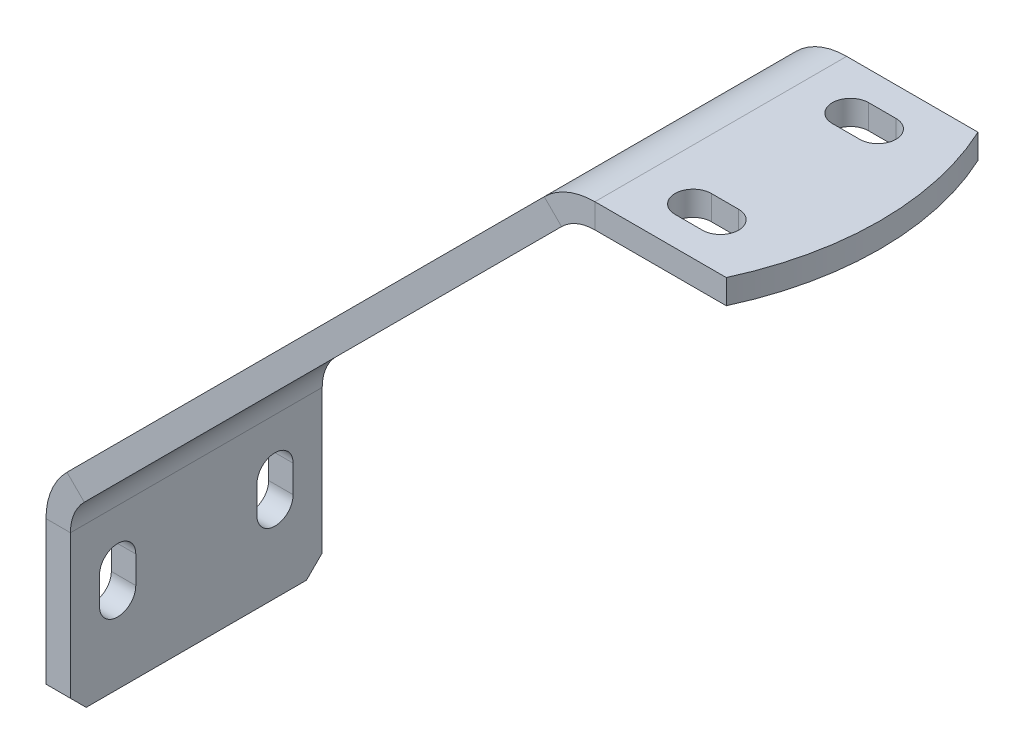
ISO-10303-21;
HEADER;
FILE_DESCRIPTION(('STEP AP214'),'2;1');
FILE_NAME('part.step','',(''),(''),'','','');
FILE_SCHEMA(('AUTOMOTIVE_DESIGN { 1 0 10303 214 1 1 1 1 }'));
ENDSEC;
DATA;
#1=APPLICATION_CONTEXT('core data for automotive mechanical design processes');
#2=APPLICATION_PROTOCOL_DEFINITION('international standard','automotive_design',2000,#1);
#3=PRODUCT_CONTEXT('',#1,'mechanical');
#4=PRODUCT('Part','Part','',(#3));
#5=PRODUCT_RELATED_PRODUCT_CATEGORY('part','',(#4));
#6=PRODUCT_DEFINITION_FORMATION('','',#4);
#7=PRODUCT_DEFINITION_CONTEXT('part definition',#1,'design');
#8=PRODUCT_DEFINITION('design','',#6,#7);
#9=PRODUCT_DEFINITION_SHAPE('','',#8);
#10=(LENGTH_UNIT() NAMED_UNIT(*) SI_UNIT(.MILLI.,.METRE.));
#11=(NAMED_UNIT(*) PLANE_ANGLE_UNIT() SI_UNIT($,.RADIAN.));
#12=(NAMED_UNIT(*) SI_UNIT($,.STERADIAN.) SOLID_ANGLE_UNIT());
#13=UNCERTAINTY_MEASURE_WITH_UNIT(LENGTH_MEASURE(1.E-05),#10,'distance_accuracy_value','');
#14=(GEOMETRIC_REPRESENTATION_CONTEXT(3) GLOBAL_UNCERTAINTY_ASSIGNED_CONTEXT((#13)) GLOBAL_UNIT_ASSIGNED_CONTEXT((#10,
#11,#12)) REPRESENTATION_CONTEXT('',''));
#15=CARTESIAN_POINT('',(0.,0.,0.));
#16=DIRECTION('',(0.,0.,1.));
#17=DIRECTION('',(1.,0.,0.));
#18=AXIS2_PLACEMENT_3D('',#15,#16,#17);
#19=CARTESIAN_POINT('',(104.775,142.875,25.4));
#20=DIRECTION('',(0.,1.,0.));
#21=DIRECTION('',(0.,0.,1.));
#22=AXIS2_PLACEMENT_3D('',#19,#20,#21);
#23=PLANE('',#22);
#24=DIRECTION('',(1.,0.,0.));
#25=VECTOR('',#24,1.);
#26=CARTESIAN_POINT('',(121.0691,142.875,-19.5326));
#27=LINE('',#26,#25);
#28=CARTESIAN_POINT('',(121.0691,142.875,-19.5326));
#29=VERTEX_POINT('',#28);
#30=CARTESIAN_POINT('',(126.5809,142.875,-19.5326));
#31=VERTEX_POINT('',#30);
#32=EDGE_CURVE('E1196',#29,#31,#27,.T.);
#33=ORIENTED_EDGE('',*,*,#32,.T.);
#34=CARTESIAN_POINT('',(126.5809,142.875,-15.875));
#35=DIRECTION('',(0.,-1.,0.));
#36=DIRECTION('',(0.,0.,-1.));
#37=AXIS2_PLACEMENT_3D('',#34,#35,#36);
#38=CIRCLE('',#37,3.6576);
#39=CARTESIAN_POINT('',(126.5809,142.875,-12.2174));
#40=VERTEX_POINT('',#39);
#41=EDGE_CURVE('E1217',#31,#40,#38,.T.);
#42=ORIENTED_EDGE('',*,*,#41,.T.);
#43=DIRECTION('',(1.,0.,0.));
#44=VECTOR('',#43,1.);
#45=CARTESIAN_POINT('',(121.0691,142.875,-12.2174));
#46=LINE('',#45,#44);
#47=CARTESIAN_POINT('',(121.0691,142.875,-12.2174));
#48=VERTEX_POINT('',#47);
#49=EDGE_CURVE('E1198',#48,#40,#46,.T.);
#50=ORIENTED_EDGE('',*,*,#49,.F.);
#51=CARTESIAN_POINT('',(121.0691,142.875,-15.875));
#52=DIRECTION('',(0.,-1.,0.));
#53=DIRECTION('',(0.,0.,-1.));
#54=AXIS2_PLACEMENT_3D('',#51,#52,#53);
#55=CIRCLE('',#54,3.6576);
#56=EDGE_CURVE('E1206',#48,#29,#55,.T.);
#57=ORIENTED_EDGE('',*,*,#56,.T.);
#58=EDGE_LOOP('',(#33,#42,#50,#57));
#59=FACE_BOUND('',#58,.T.);
#60=CARTESIAN_POINT('',(121.0691,142.875,15.875));
#61=DIRECTION('',(0.,-1.,0.));
#62=DIRECTION('',(0.,0.,-1.));
#63=AXIS2_PLACEMENT_3D('',#60,#61,#62);
#64=CIRCLE('',#63,3.6576);
#65=CARTESIAN_POINT('',(121.0691,142.875,19.5326));
#66=VERTEX_POINT('',#65);
#67=CARTESIAN_POINT('',(121.0691,142.875,12.2174));
#68=VERTEX_POINT('',#67);
#69=EDGE_CURVE('E371',#66,#68,#64,.T.);
#70=ORIENTED_EDGE('',*,*,#69,.T.);
#71=DIRECTION('',(1.,0.,0.));
#72=VECTOR('',#71,1.);
#73=CARTESIAN_POINT('',(121.0691,142.875,12.2174));
#74=LINE('',#73,#72);
#75=CARTESIAN_POINT('',(126.5809,142.875,12.2174));
#76=VERTEX_POINT('',#75);
#77=EDGE_CURVE('E1166',#68,#76,#74,.T.);
#78=ORIENTED_EDGE('',*,*,#77,.T.);
#79=CARTESIAN_POINT('',(126.5809,142.875,15.875));
#80=DIRECTION('',(0.,-1.,0.));
#81=DIRECTION('',(0.,0.,-1.));
#82=AXIS2_PLACEMENT_3D('',#79,#80,#81);
#83=CIRCLE('',#82,3.6576);
#84=CARTESIAN_POINT('',(126.5809,142.875,19.5326));
#85=VERTEX_POINT('',#84);
#86=EDGE_CURVE('E1174',#76,#85,#83,.T.);
#87=ORIENTED_EDGE('',*,*,#86,.T.);
#88=DIRECTION('',(1.,0.,0.));
#89=VECTOR('',#88,1.);
#90=CARTESIAN_POINT('',(121.0691,142.875,19.5326));
#91=LINE('',#90,#89);
#92=EDGE_CURVE('E1175',#66,#85,#91,.T.);
#93=ORIENTED_EDGE('',*,*,#92,.F.);
#94=EDGE_LOOP('',(#70,#78,#87,#93));
#95=FACE_BOUND('',#94,.T.);
#96=CARTESIAN_POINT('',(82.5500000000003,142.875,0.));
#97=DIRECTION('',(0.,-1.,0.));
#98=DIRECTION('',(0.,0.,-1.));
#99=AXIS2_PLACEMENT_3D('',#96,#97,#98);
#100=CIRCLE('',#99,60.325);
#101=CARTESIAN_POINT('',(137.266959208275,142.875,-25.4));
#102=VERTEX_POINT('',#101);
#103=CARTESIAN_POINT('',(137.266959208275,142.875,25.4));
#104=VERTEX_POINT('',#103);
#105=EDGE_CURVE('E548',#102,#104,#100,.T.);
#106=ORIENTED_EDGE('',*,*,#105,.F.);
#107=DIRECTION('',(1.,0.,0.));
#108=VECTOR('',#107,1.);
#109=CARTESIAN_POINT('',(104.775,142.875,-25.4));
#110=LINE('',#109,#108);
#111=CARTESIAN_POINT('',(110.764619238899,142.875,-25.4));
#112=VERTEX_POINT('',#111);
#113=EDGE_CURVE('E552',#112,#102,#110,.T.);
#114=ORIENTED_EDGE('',*,*,#113,.F.);
#115=DIRECTION('',(0.,0.,-1.));
#116=VECTOR('',#115,1.);
#117=CARTESIAN_POINT('',(110.764619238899,142.875,25.4));
#118=LINE('',#117,#116);
#119=CARTESIAN_POINT('',(110.764619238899,142.875,25.4));
#120=VERTEX_POINT('',#119);
#121=EDGE_CURVE('E628',#120,#112,#118,.T.);
#122=ORIENTED_EDGE('',*,*,#121,.F.);
#123=DIRECTION('',(1.,0.,0.));
#124=VECTOR('',#123,1.);
#125=CARTESIAN_POINT('',(104.775,142.875,25.4));
#126=LINE('',#125,#124);
#127=EDGE_CURVE('E555',#120,#104,#126,.T.);
#128=ORIENTED_EDGE('',*,*,#127,.T.);
#129=EDGE_LOOP('',(#106,#114,#122,#128));
#130=FACE_BOUND('',#129,.T.);
#131=ADVANCED_FACE('F348',(#59,#95,#130),#23,.T.);
#132=CARTESIAN_POINT('',(104.775,137.93978,25.4));
#133=DIRECTION('',(0.,1.,0.));
#134=DIRECTION('',(0.,0.,1.));
#135=AXIS2_PLACEMENT_3D('',#132,#133,#134);
#136=PLANE('',#135);
#137=DIRECTION('',(1.,0.,0.));
#138=VECTOR('',#137,1.);
#139=CARTESIAN_POINT('',(121.0691,137.93978,19.5326));
#140=LINE('',#139,#138);
#141=CARTESIAN_POINT('',(121.0691,137.93978,19.5326));
#142=VERTEX_POINT('',#141);
#143=CARTESIAN_POINT('',(126.5809,137.93978,19.5326));
#144=VERTEX_POINT('',#143);
#145=EDGE_CURVE('E1177',#142,#144,#140,.T.);
#146=ORIENTED_EDGE('',*,*,#145,.T.);
#147=CARTESIAN_POINT('',(126.5809,137.93978,15.875));
#148=DIRECTION('',(0.,-1.,0.));
#149=DIRECTION('',(0.,0.,-1.));
#150=AXIS2_PLACEMENT_3D('',#147,#148,#149);
#151=CIRCLE('',#150,3.6576);
#152=CARTESIAN_POINT('',(126.5809,137.93978,12.2174));
#153=VERTEX_POINT('',#152);
#154=EDGE_CURVE('E363',#153,#144,#151,.T.);
#155=ORIENTED_EDGE('',*,*,#154,.F.);
#156=DIRECTION('',(1.,0.,0.));
#157=VECTOR('',#156,1.);
#158=CARTESIAN_POINT('',(121.0691,137.93978,12.2174));
#159=LINE('',#158,#157);
#160=CARTESIAN_POINT('',(121.0691,137.93978,12.2174));
#161=VERTEX_POINT('',#160);
#162=EDGE_CURVE('E1168',#161,#153,#159,.T.);
#163=ORIENTED_EDGE('',*,*,#162,.F.);
#164=CARTESIAN_POINT('',(121.0691,137.93978,15.875));
#165=DIRECTION('',(0.,-1.,0.));
#166=DIRECTION('',(0.,0.,-1.));
#167=AXIS2_PLACEMENT_3D('',#164,#165,#166);
#168=CIRCLE('',#167,3.6576);
#169=EDGE_CURVE('E1184',#142,#161,#168,.T.);
#170=ORIENTED_EDGE('',*,*,#169,.F.);
#171=EDGE_LOOP('',(#146,#155,#163,#170));
#172=FACE_BOUND('',#171,.T.);
#173=CARTESIAN_POINT('',(121.0691,137.93978,-15.875));
#174=DIRECTION('',(0.,-1.,0.));
#175=DIRECTION('',(0.,0.,-1.));
#176=AXIS2_PLACEMENT_3D('',#173,#174,#175);
#177=CIRCLE('',#176,3.6576);
#178=CARTESIAN_POINT('',(121.0691,137.93978,-12.2174));
#179=VERTEX_POINT('',#178);
#180=CARTESIAN_POINT('',(121.0691,137.93978,-19.5326));
#181=VERTEX_POINT('',#180);
#182=EDGE_CURVE('E1203',#179,#181,#177,.T.);
#183=ORIENTED_EDGE('',*,*,#182,.F.);
#184=DIRECTION('',(1.,0.,0.));
#185=VECTOR('',#184,1.);
#186=CARTESIAN_POINT('',(121.0691,137.93978,-12.2174));
#187=LINE('',#186,#185);
#188=CARTESIAN_POINT('',(126.5809,137.93978,-12.2174));
#189=VERTEX_POINT('',#188);
#190=EDGE_CURVE('E1200',#179,#189,#187,.T.);
#191=ORIENTED_EDGE('',*,*,#190,.T.);
#192=CARTESIAN_POINT('',(126.5809,137.93978,-15.875));
#193=DIRECTION('',(0.,-1.,0.));
#194=DIRECTION('',(0.,0.,-1.));
#195=AXIS2_PLACEMENT_3D('',#192,#193,#194);
#196=CIRCLE('',#195,3.6576);
#197=CARTESIAN_POINT('',(126.5809,137.93978,-19.5326));
#198=VERTEX_POINT('',#197);
#199=EDGE_CURVE('E1214',#198,#189,#196,.T.);
#200=ORIENTED_EDGE('',*,*,#199,.F.);
#201=DIRECTION('',(1.,0.,0.));
#202=VECTOR('',#201,1.);
#203=CARTESIAN_POINT('',(121.0691,137.93978,-19.5326));
#204=LINE('',#203,#202);
#205=EDGE_CURVE('E1169',#181,#198,#204,.T.);
#206=ORIENTED_EDGE('',*,*,#205,.F.);
#207=EDGE_LOOP('',(#183,#191,#200,#206));
#208=FACE_BOUND('',#207,.T.);
#209=DIRECTION('',(1.,0.,0.));
#210=VECTOR('',#209,1.);
#211=CARTESIAN_POINT('',(104.775,137.93978,-25.4));
#212=LINE('',#211,#210);
#213=CARTESIAN_POINT('',(110.764619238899,137.93978,-25.4));
#214=VERTEX_POINT('',#213);
#215=CARTESIAN_POINT('',(137.266959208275,137.93978,-25.4));
#216=VERTEX_POINT('',#215);
#217=EDGE_CURVE('E573',#214,#216,#212,.T.);
#218=ORIENTED_EDGE('',*,*,#217,.T.);
#219=CARTESIAN_POINT('',(82.5500000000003,137.93978,0.));
#220=DIRECTION('',(0.,-1.,0.));
#221=DIRECTION('',(0.,0.,-1.));
#222=AXIS2_PLACEMENT_3D('',#219,#220,#221);
#223=CIRCLE('',#222,60.325);
#224=CARTESIAN_POINT('',(137.266959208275,137.93978,25.4));
#225=VERTEX_POINT('',#224);
#226=EDGE_CURVE('E559',#216,#225,#223,.T.);
#227=ORIENTED_EDGE('',*,*,#226,.T.);
#228=DIRECTION('',(1.,0.,0.));
#229=VECTOR('',#228,1.);
#230=CARTESIAN_POINT('',(104.775,137.93978,25.4));
#231=LINE('',#230,#229);
#232=CARTESIAN_POINT('',(110.764619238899,137.93978,25.4));
#233=VERTEX_POINT('',#232);
#234=EDGE_CURVE('E599',#233,#225,#231,.T.);
#235=ORIENTED_EDGE('',*,*,#234,.F.);
#236=DIRECTION('',(0.,0.,-1.));
#237=VECTOR('',#236,1.);
#238=CARTESIAN_POINT('',(110.764619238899,137.93978,25.4));
#239=LINE('',#238,#237);
#240=EDGE_CURVE('E600',#233,#214,#239,.T.);
#241=ORIENTED_EDGE('',*,*,#240,.T.);
#242=EDGE_LOOP('',(#218,#227,#235,#241));
#243=FACE_BOUND('',#242,.T.);
#244=ADVANCED_FACE('F730',(#172,#208,#243),#136,.F.);
#245=CARTESIAN_POINT('',(110.764619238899,128.41478,-25.4));
#246=DIRECTION('',(0.,0.,1.));
#247=DIRECTION('',(1.,0.,0.));
#248=AXIS2_PLACEMENT_3D('',#245,#246,#247);
#249=PLANE('',#248);
#250=DIRECTION('',(0.,-1.,0.));
#251=VECTOR('',#250,1.);
#252=CARTESIAN_POINT('',(137.266959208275,142.875,-25.4));
#253=LINE('',#252,#251);
#254=EDGE_CURVE('E562',#102,#216,#253,.T.);
#255=ORIENTED_EDGE('',*,*,#254,.T.);
#256=ORIENTED_EDGE('',*,*,#217,.F.);
#257=DIRECTION('',(0.,1.,0.));
#258=VECTOR('',#257,1.);
#259=CARTESIAN_POINT('',(110.764619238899,137.93978,-25.4));
#260=LINE('',#259,#258);
#261=EDGE_CURVE('E570',#214,#112,#260,.T.);
#262=ORIENTED_EDGE('',*,*,#261,.T.);
#263=ORIENTED_EDGE('',*,*,#113,.T.);
#264=EDGE_LOOP('',(#255,#256,#262,#263));
#265=FACE_BOUND('',#264,.T.);
#266=ADVANCED_FACE('F569',(#265),#249,.F.);
#267=CARTESIAN_POINT('',(104.029427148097,135.149972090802,25.4));
#268=DIRECTION('',(0.,0.,1.));
#269=DIRECTION('',(1.,0.,0.));
#270=AXIS2_PLACEMENT_3D('',#267,#268,#269);
#271=PLANE('',#270);
#272=ORIENTED_EDGE('',*,*,#234,.T.);
#273=DIRECTION('',(0.,-1.,0.));
#274=VECTOR('',#273,1.);
#275=CARTESIAN_POINT('',(137.266959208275,142.875,25.4));
#276=LINE('',#275,#274);
#277=EDGE_CURVE('E558',#104,#225,#276,.T.);
#278=ORIENTED_EDGE('',*,*,#277,.F.);
#279=ORIENTED_EDGE('',*,*,#127,.F.);
#280=DIRECTION('',(0.,-1.,0.));
#281=VECTOR('',#280,1.);
#282=CARTESIAN_POINT('',(110.764619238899,142.875,25.4));
#283=LINE('',#282,#281);
#284=EDGE_CURVE('E635',#120,#233,#283,.T.);
#285=ORIENTED_EDGE('',*,*,#284,.T.);
#286=EDGE_LOOP('',(#272,#278,#279,#285));
#287=FACE_BOUND('',#286,.T.);
#288=ADVANCED_FACE('F785',(#287),#271,.T.);
#289=CARTESIAN_POINT('',(0.,0.,25.4));
#290=DIRECTION('',(-1.,0.,0.));
#291=DIRECTION('',(0.,0.,1.));
#292=AXIS2_PLACEMENT_3D('',#289,#290,#291);
#293=PLANE('',#292);
#294=DIRECTION('',(0.,1.,0.));
#295=VECTOR('',#294,1.);
#296=CARTESIAN_POINT('',(0.,0.,-25.4));
#297=LINE('',#296,#295);
#298=CARTESIAN_POINT('',(0.,3.175,-25.4));
#299=VERTEX_POINT('',#298);
#300=CARTESIAN_POINT('',(0.,32.1103807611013,-25.4));
#301=VERTEX_POINT('',#300);
#302=EDGE_CURVE('E586',#299,#301,#297,.T.);
#303=ORIENTED_EDGE('',*,*,#302,.F.);
#304=DIRECTION('',(0.,0.707106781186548,-0.707106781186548));
#305=VECTOR('',#304,1.);
#306=CARTESIAN_POINT('',(0.,-23.8125,1.5875));
#307=LINE('',#306,#305);
#308=CARTESIAN_POINT('',(0.,0.,-22.225));
#309=VERTEX_POINT('',#308);
#310=EDGE_CURVE('E659',#299,#309,#307,.F.);
#311=ORIENTED_EDGE('',*,*,#310,.T.);
#312=DIRECTION('',(0.,0.,-1.));
#313=VECTOR('',#312,1.);
#314=CARTESIAN_POINT('',(0.,0.,25.4));
#315=LINE('',#314,#313);
#316=CARTESIAN_POINT('',(0.,0.,22.225));
#317=VERTEX_POINT('',#316);
#318=EDGE_CURVE('E616',#317,#309,#315,.T.);
#319=ORIENTED_EDGE('',*,*,#318,.F.);
#320=DIRECTION('',(0.,-0.707106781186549,-0.707106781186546));
#321=VECTOR('',#320,1.);
#322=CARTESIAN_POINT('',(0.,1.5875,23.8125));
#323=LINE('',#322,#321);
#324=CARTESIAN_POINT('',(0.,3.17500000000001,25.4));
#325=VERTEX_POINT('',#324);
#326=EDGE_CURVE('E650',#317,#325,#323,.F.);
#327=ORIENTED_EDGE('',*,*,#326,.T.);
#328=DIRECTION('',(0.,1.,0.));
#329=VECTOR('',#328,1.);
#330=CARTESIAN_POINT('',(0.,0.,25.4));
#331=LINE('',#330,#329);
#332=CARTESIAN_POINT('',(0.,32.1103807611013,25.4));
#333=VERTEX_POINT('',#332);
#334=EDGE_CURVE('E684',#325,#333,#331,.T.);
#335=ORIENTED_EDGE('',*,*,#334,.T.);
#336=DIRECTION('',(0.,0.,-1.));
#337=VECTOR('',#336,1.);
#338=CARTESIAN_POINT('',(0.,32.1103807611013,25.4));
#339=LINE('',#338,#337);
#340=EDGE_CURVE('E619',#333,#301,#339,.T.);
#341=ORIENTED_EDGE('',*,*,#340,.T.);
#342=EDGE_LOOP('',(#303,#311,#319,#327,#335,#341));
#343=FACE_BOUND('',#342,.T.);
#344=DIRECTION('',(0.,1.,0.));
#345=VECTOR('',#344,1.);
#346=CARTESIAN_POINT('',(0.,16.2941,-19.5326));
#347=LINE('',#346,#345);
#348=CARTESIAN_POINT('',(0.,16.2941,-19.5326));
#349=VERTEX_POINT('',#348);
#350=CARTESIAN_POINT('',(0.,21.8059,-19.5326));
#351=VERTEX_POINT('',#350);
#352=EDGE_CURVE('E1259',#349,#351,#347,.T.);
#353=ORIENTED_EDGE('',*,*,#352,.T.);
#354=CARTESIAN_POINT('',(0.,21.8059,-15.875));
#355=DIRECTION('',(1.,0.,0.));
#356=DIRECTION('',(0.,0.,-1.));
#357=AXIS2_PLACEMENT_3D('',#354,#355,#356);
#358=CIRCLE('',#357,3.6576);
#359=CARTESIAN_POINT('',(0.,21.8059,-12.2174));
#360=VERTEX_POINT('',#359);
#361=EDGE_CURVE('E1280',#351,#360,#358,.T.);
#362=ORIENTED_EDGE('',*,*,#361,.T.);
#363=DIRECTION('',(0.,1.,0.));
#364=VECTOR('',#363,1.);
#365=CARTESIAN_POINT('',(0.,16.2941,-12.2174));
#366=LINE('',#365,#364);
#367=CARTESIAN_POINT('',(0.,16.2941,-12.2174));
#368=VERTEX_POINT('',#367);
#369=EDGE_CURVE('E1262',#368,#360,#366,.T.);
#370=ORIENTED_EDGE('',*,*,#369,.F.);
#371=CARTESIAN_POINT('',(0.,16.2941,-15.875));
#372=DIRECTION('',(1.,0.,0.));
#373=DIRECTION('',(0.,0.,-1.));
#374=AXIS2_PLACEMENT_3D('',#371,#372,#373);
#375=CIRCLE('',#374,3.6576);
#376=EDGE_CURVE('E1270',#368,#349,#375,.T.);
#377=ORIENTED_EDGE('',*,*,#376,.T.);
#378=EDGE_LOOP('',(#353,#362,#370,#377));
#379=FACE_BOUND('',#378,.T.);
#380=DIRECTION('',(0.,1.,0.));
#381=VECTOR('',#380,1.);
#382=CARTESIAN_POINT('',(0.,16.2941,12.2174));
#383=LINE('',#382,#381);
#384=CARTESIAN_POINT('',(0.,16.2941,12.2174));
#385=VERTEX_POINT('',#384);
#386=CARTESIAN_POINT('',(0.,21.8059,12.2174));
#387=VERTEX_POINT('',#386);
#388=EDGE_CURVE('E1227',#385,#387,#383,.T.);
#389=ORIENTED_EDGE('',*,*,#388,.T.);
#390=CARTESIAN_POINT('',(0.,21.8059,15.875));
#391=DIRECTION('',(1.,0.,0.));
#392=DIRECTION('',(0.,0.,-1.));
#393=AXIS2_PLACEMENT_3D('',#390,#391,#392);
#394=CIRCLE('',#393,3.6576);
#395=CARTESIAN_POINT('',(0.,21.8059,19.5326));
#396=VERTEX_POINT('',#395);
#397=EDGE_CURVE('E1249',#387,#396,#394,.T.);
#398=ORIENTED_EDGE('',*,*,#397,.T.);
#399=DIRECTION('',(0.,1.,0.));
#400=VECTOR('',#399,1.);
#401=CARTESIAN_POINT('',(0.,16.2941,19.5326));
#402=LINE('',#401,#400);
#403=CARTESIAN_POINT('',(0.,16.2941,19.5326));
#404=VERTEX_POINT('',#403);
#405=EDGE_CURVE('E1230',#404,#396,#402,.T.);
#406=ORIENTED_EDGE('',*,*,#405,.F.);
#407=CARTESIAN_POINT('',(0.,16.2941,15.875));
#408=DIRECTION('',(1.,0.,0.));
#409=DIRECTION('',(0.,0.,-1.));
#410=AXIS2_PLACEMENT_3D('',#407,#408,#409);
#411=CIRCLE('',#410,3.6576);
#412=EDGE_CURVE('E1238',#404,#385,#411,.T.);
#413=ORIENTED_EDGE('',*,*,#412,.T.);
#414=EDGE_LOOP('',(#389,#398,#406,#413));
#415=FACE_BOUND('',#414,.T.);
#416=ADVANCED_FACE('F679',(#343,#379,#415),#293,.T.);
#417=CARTESIAN_POINT('',(4.23530038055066,42.3353003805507,25.4));
#418=DIRECTION('',(0.,0.,1.));
#419=DIRECTION('',(1.,0.,0.));
#420=AXIS2_PLACEMENT_3D('',#417,#418,#419);
#421=PLANE('',#420);
#422=DIRECTION('',(0.707106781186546,-0.707106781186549,0.));
#423=VECTOR('',#422,1.);
#424=CARTESIAN_POINT('',(4.23530038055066,42.3353003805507,25.4));
#425=LINE('',#424,#423);
#426=CARTESIAN_POINT('',(4.23530038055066,42.3353003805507,25.4));
#427=VERTEX_POINT('',#426);
#428=CARTESIAN_POINT('',(7.72502790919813,38.8455728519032,25.4));
#429=VERTEX_POINT('',#428);
#430=EDGE_CURVE('E645',#427,#429,#425,.T.);
#431=ORIENTED_EDGE('',*,*,#430,.F.);
#432=CARTESIAN_POINT('',(14.46022,32.1103807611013,25.4));
#433=DIRECTION('',(0.,0.,1.));
#434=DIRECTION('',(1.,0.,0.));
#435=AXIS2_PLACEMENT_3D('',#432,#433,#434);
#436=CIRCLE('',#435,14.46022);
#437=EDGE_CURVE('E709',#333,#427,#436,.F.);
#438=ORIENTED_EDGE('',*,*,#437,.F.);
#439=DIRECTION('',(-1.,0.,0.));
#440=VECTOR('',#439,1.);
#441=CARTESIAN_POINT('',(4.93522,32.1103807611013,25.4));
#442=LINE('',#441,#440);
#443=CARTESIAN_POINT('',(4.93522,32.1103807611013,25.4));
#444=VERTEX_POINT('',#443);
#445=EDGE_CURVE('E642',#444,#333,#442,.T.);
#446=ORIENTED_EDGE('',*,*,#445,.F.);
#447=CARTESIAN_POINT('',(14.46022,32.1103807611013,25.4));
#448=DIRECTION('',(0.,0.,1.));
#449=DIRECTION('',(1.,0.,0.));
#450=AXIS2_PLACEMENT_3D('',#447,#448,#449);
#451=CIRCLE('',#450,9.525);
#452=EDGE_CURVE('E700',#444,#429,#451,.F.);
#453=ORIENTED_EDGE('',*,*,#452,.T.);
#454=EDGE_LOOP('',(#431,#438,#446,#453));
#455=FACE_BOUND('',#454,.T.);
#456=ADVANCED_FACE('F748',(#455),#421,.T.);
#457=CARTESIAN_POINT('',(4.93522,32.1103807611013,25.4));
#458=DIRECTION('',(0.,0.,1.));
#459=DIRECTION('',(1.,0.,0.));
#460=AXIS2_PLACEMENT_3D('',#457,#458,#459);
#461=PLANE('',#460);
#462=DIRECTION('',(0.707106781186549,0.707106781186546,0.));
#463=VECTOR('',#462,1.);
#464=CARTESIAN_POINT('',(0.,38.1,25.4));
#465=LINE('',#464,#463);
#466=CARTESIAN_POINT('',(100.53969961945,138.639699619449,25.4));
#467=VERTEX_POINT('',#466);
#468=EDGE_CURVE('E711',#427,#467,#465,.T.);
#469=ORIENTED_EDGE('',*,*,#468,.F.);
#470=ORIENTED_EDGE('',*,*,#430,.T.);
#471=DIRECTION('',(0.707106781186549,0.707106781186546,0.));
#472=VECTOR('',#471,1.);
#473=CARTESIAN_POINT('',(3.48972752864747,34.6102724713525,25.4));
#474=LINE('',#473,#472);
#475=CARTESIAN_POINT('',(104.029427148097,135.149972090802,25.4));
#476=VERTEX_POINT('',#475);
#477=EDGE_CURVE('E716',#429,#476,#474,.T.);
#478=ORIENTED_EDGE('',*,*,#477,.T.);
#479=DIRECTION('',(-0.707106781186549,0.707106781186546,0.));
#480=VECTOR('',#479,1.);
#481=CARTESIAN_POINT('',(104.029427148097,135.149972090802,25.4));
#482=LINE('',#481,#480);
#483=EDGE_CURVE('E633',#476,#467,#482,.T.);
#484=ORIENTED_EDGE('',*,*,#483,.T.);
#485=EDGE_LOOP('',(#469,#470,#478,#484));
#486=FACE_BOUND('',#485,.T.);
#487=ADVANCED_FACE('F746',(#486),#461,.T.);
#488=CARTESIAN_POINT('',(0.,32.1103807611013,-25.4));
#489=DIRECTION('',(0.,0.,-1.));
#490=DIRECTION('',(-1.,0.,0.));
#491=AXIS2_PLACEMENT_3D('',#488,#489,#490);
#492=PLANE('',#491);
#493=DIRECTION('',(1.,0.,0.));
#494=VECTOR('',#493,1.);
#495=CARTESIAN_POINT('',(0.,32.1103807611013,-25.4));
#496=LINE('',#495,#494);
#497=CARTESIAN_POINT('',(4.93522,32.1103807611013,-25.4));
#498=VERTEX_POINT('',#497);
#499=EDGE_CURVE('E639',#301,#498,#496,.T.);
#500=ORIENTED_EDGE('',*,*,#499,.F.);
#501=CARTESIAN_POINT('',(14.46022,32.1103807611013,-25.4));
#502=DIRECTION('',(0.,0.,1.));
#503=DIRECTION('',(1.,0.,0.));
#504=AXIS2_PLACEMENT_3D('',#501,#502,#503);
#505=CIRCLE('',#504,14.46022);
#506=CARTESIAN_POINT('',(4.23530038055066,42.3353003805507,-25.4));
#507=VERTEX_POINT('',#506);
#508=EDGE_CURVE('E583',#301,#507,#505,.F.);
#509=ORIENTED_EDGE('',*,*,#508,.T.);
#510=DIRECTION('',(-0.707106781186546,0.707106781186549,0.));
#511=VECTOR('',#510,1.);
#512=CARTESIAN_POINT('',(7.72502790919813,38.8455728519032,-25.4));
#513=LINE('',#512,#511);
#514=CARTESIAN_POINT('',(7.72502790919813,38.8455728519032,-25.4));
#515=VERTEX_POINT('',#514);
#516=EDGE_CURVE('E637',#515,#507,#513,.T.);
#517=ORIENTED_EDGE('',*,*,#516,.F.);
#518=CARTESIAN_POINT('',(14.46022,32.1103807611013,-25.4));
#519=DIRECTION('',(0.,0.,1.));
#520=DIRECTION('',(1.,0.,0.));
#521=AXIS2_PLACEMENT_3D('',#518,#519,#520);
#522=CIRCLE('',#521,9.525);
#523=EDGE_CURVE('E590',#498,#515,#522,.F.);
#524=ORIENTED_EDGE('',*,*,#523,.F.);
#525=EDGE_LOOP('',(#500,#509,#517,#524));
#526=FACE_BOUND('',#525,.T.);
#527=ADVANCED_FACE('F692',(#526),#492,.T.);
#528=CARTESIAN_POINT('',(7.72502790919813,38.8455728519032,-25.4));
#529=DIRECTION('',(0.,0.,-1.));
#530=DIRECTION('',(-1.,0.,0.));
#531=AXIS2_PLACEMENT_3D('',#528,#529,#530);
#532=PLANE('',#531);
#533=DIRECTION('',(0.,1.,0.));
#534=VECTOR('',#533,1.);
#535=CARTESIAN_POINT('',(4.93522,0.,-25.4));
#536=LINE('',#535,#534);
#537=CARTESIAN_POINT('',(4.93522,3.175,-25.4));
#538=VERTEX_POINT('',#537);
#539=EDGE_CURVE('E588',#538,#498,#536,.T.);
#540=ORIENTED_EDGE('',*,*,#539,.F.);
#541=DIRECTION('',(-1.,0.,0.));
#542=VECTOR('',#541,1.);
#543=CARTESIAN_POINT('',(7.72502790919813,3.175,-25.4));
#544=LINE('',#543,#542);
#545=EDGE_CURVE('E656',#538,#299,#544,.T.);
#546=ORIENTED_EDGE('',*,*,#545,.T.);
#547=ORIENTED_EDGE('',*,*,#302,.T.);
#548=ORIENTED_EDGE('',*,*,#499,.T.);
#549=EDGE_LOOP('',(#540,#546,#547,#548));
#550=FACE_BOUND('',#549,.T.);
#551=ADVANCED_FACE('F676',(#550),#532,.T.);
#552=CARTESIAN_POINT('',(110.764619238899,142.875,25.4));
#553=DIRECTION('',(0.,0.,1.));
#554=DIRECTION('',(1.,0.,0.));
#555=AXIS2_PLACEMENT_3D('',#552,#553,#554);
#556=PLANE('',#555);
#557=ORIENTED_EDGE('',*,*,#284,.F.);
#558=CARTESIAN_POINT('',(110.764619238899,128.41478,25.4));
#559=DIRECTION('',(0.,0.,1.));
#560=DIRECTION('',(1.,0.,0.));
#561=AXIS2_PLACEMENT_3D('',#558,#559,#560);
#562=CIRCLE('',#561,14.46022);
#563=EDGE_CURVE('E733',#467,#120,#562,.F.);
#564=ORIENTED_EDGE('',*,*,#563,.F.);
#565=ORIENTED_EDGE('',*,*,#483,.F.);
#566=CARTESIAN_POINT('',(110.764619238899,128.41478,25.4));
#567=DIRECTION('',(0.,0.,1.));
#568=DIRECTION('',(1.,0.,0.));
#569=AXIS2_PLACEMENT_3D('',#566,#567,#568);
#570=CIRCLE('',#569,9.525);
#571=EDGE_CURVE('E604',#476,#233,#570,.F.);
#572=ORIENTED_EDGE('',*,*,#571,.T.);
#573=EDGE_LOOP('',(#557,#564,#565,#572));
#574=FACE_BOUND('',#573,.T.);
#575=ADVANCED_FACE('F722',(#574),#556,.T.);
#576=CARTESIAN_POINT('',(100.53969961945,138.639699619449,-25.4));
#577=DIRECTION('',(0.,0.,-1.));
#578=DIRECTION('',(-1.,0.,0.));
#579=AXIS2_PLACEMENT_3D('',#576,#577,#578);
#580=PLANE('',#579);
#581=DIRECTION('',(0.707106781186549,-0.707106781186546,0.));
#582=VECTOR('',#581,1.);
#583=CARTESIAN_POINT('',(100.53969961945,138.639699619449,-25.4));
#584=LINE('',#583,#582);
#585=CARTESIAN_POINT('',(100.53969961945,138.639699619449,-25.4));
#586=VERTEX_POINT('',#585);
#587=CARTESIAN_POINT('',(104.029427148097,135.149972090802,-25.4));
#588=VERTEX_POINT('',#587);
#589=EDGE_CURVE('E631',#586,#588,#584,.T.);
#590=ORIENTED_EDGE('',*,*,#589,.F.);
#591=CARTESIAN_POINT('',(110.764619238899,128.41478,-25.4));
#592=DIRECTION('',(0.,0.,1.));
#593=DIRECTION('',(1.,0.,0.));
#594=AXIS2_PLACEMENT_3D('',#591,#592,#593);
#595=CIRCLE('',#594,14.46022);
#596=EDGE_CURVE('E572',#586,#112,#595,.F.);
#597=ORIENTED_EDGE('',*,*,#596,.T.);
#598=ORIENTED_EDGE('',*,*,#261,.F.);
#599=CARTESIAN_POINT('',(110.764619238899,128.41478,-25.4));
#600=DIRECTION('',(0.,0.,1.));
#601=DIRECTION('',(1.,0.,0.));
#602=AXIS2_PLACEMENT_3D('',#599,#600,#601);
#603=CIRCLE('',#602,9.525);
#604=EDGE_CURVE('E596',#588,#214,#603,.F.);
#605=ORIENTED_EDGE('',*,*,#604,.F.);
#606=EDGE_LOOP('',(#590,#597,#598,#605));
#607=FACE_BOUND('',#606,.T.);
#608=ADVANCED_FACE('F755',(#607),#580,.T.);
#609=CARTESIAN_POINT('',(110.764619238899,137.93978,-25.4));
#610=DIRECTION('',(0.,0.,-1.));
#611=DIRECTION('',(-1.,0.,0.));
#612=AXIS2_PLACEMENT_3D('',#609,#610,#611);
#613=PLANE('',#612);
#614=DIRECTION('',(0.707106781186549,0.707106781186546,0.));
#615=VECTOR('',#614,1.);
#616=CARTESIAN_POINT('',(0.,38.1,-25.4));
#617=LINE('',#616,#615);
#618=EDGE_CURVE('E575',#507,#586,#617,.T.);
#619=ORIENTED_EDGE('',*,*,#618,.T.);
#620=ORIENTED_EDGE('',*,*,#589,.T.);
#621=DIRECTION('',(0.707106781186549,0.707106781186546,0.));
#622=VECTOR('',#621,1.);
#623=CARTESIAN_POINT('',(3.48972752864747,34.6102724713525,-25.4));
#624=LINE('',#623,#622);
#625=EDGE_CURVE('E593',#515,#588,#624,.T.);
#626=ORIENTED_EDGE('',*,*,#625,.F.);
#627=ORIENTED_EDGE('',*,*,#516,.T.);
#628=EDGE_LOOP('',(#619,#620,#626,#627));
#629=FACE_BOUND('',#628,.T.);
#630=ADVANCED_FACE('F759',(#629),#613,.T.);
#631=CARTESIAN_POINT('',(110.764619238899,128.41478,25.4));
#632=DIRECTION('',(0.,0.,-1.));
#633=DIRECTION('',(-1.,0.,0.));
#634=AXIS2_PLACEMENT_3D('',#631,#632,#633);
#635=CYLINDRICAL_SURFACE('',#634,14.46022);
#636=ORIENTED_EDGE('',*,*,#596,.F.);
#637=DIRECTION('',(0.,0.,-1.));
#638=VECTOR('',#637,1.);
#639=CARTESIAN_POINT('',(100.53969961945,138.639699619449,25.4));
#640=LINE('',#639,#638);
#641=EDGE_CURVE('E625',#467,#586,#640,.T.);
#642=ORIENTED_EDGE('',*,*,#641,.F.);
#643=ORIENTED_EDGE('',*,*,#563,.T.);
#644=ORIENTED_EDGE('',*,*,#121,.T.);
#645=EDGE_LOOP('',(#636,#642,#643,#644));
#646=FACE_BOUND('',#645,.T.);
#647=ADVANCED_FACE('F757',(#646),#635,.T.);
#648=CARTESIAN_POINT('',(0.,38.1,25.4));
#649=DIRECTION('',(-0.707106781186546,0.707106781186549,0.));
#650=DIRECTION('',(-0.707106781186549,-0.707106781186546,0.));
#651=AXIS2_PLACEMENT_3D('',#648,#649,#650);
#652=PLANE('',#651);
#653=ORIENTED_EDGE('',*,*,#618,.F.);
#654=DIRECTION('',(0.,0.,-1.));
#655=VECTOR('',#654,1.);
#656=CARTESIAN_POINT('',(4.23530038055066,42.3353003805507,25.4));
#657=LINE('',#656,#655);
#658=EDGE_CURVE('E622',#427,#507,#657,.T.);
#659=ORIENTED_EDGE('',*,*,#658,.F.);
#660=ORIENTED_EDGE('',*,*,#468,.T.);
#661=ORIENTED_EDGE('',*,*,#641,.T.);
#662=EDGE_LOOP('',(#653,#659,#660,#661));
#663=FACE_BOUND('',#662,.T.);
#664=ADVANCED_FACE('F742',(#663),#652,.T.);
#665=CARTESIAN_POINT('',(14.46022,32.1103807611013,25.4));
#666=DIRECTION('',(0.,0.,-1.));
#667=DIRECTION('',(-1.,0.,0.));
#668=AXIS2_PLACEMENT_3D('',#665,#666,#667);
#669=CYLINDRICAL_SURFACE('',#668,14.46022);
#670=ORIENTED_EDGE('',*,*,#508,.F.);
#671=ORIENTED_EDGE('',*,*,#340,.F.);
#672=ORIENTED_EDGE('',*,*,#437,.T.);
#673=ORIENTED_EDGE('',*,*,#658,.T.);
#674=EDGE_LOOP('',(#670,#671,#672,#673));
#675=FACE_BOUND('',#674,.T.);
#676=ADVANCED_FACE('F688',(#675),#669,.T.);
#677=CARTESIAN_POINT('',(4.93522,0.,25.4));
#678=DIRECTION('',(0.,-1.,0.));
#679=DIRECTION('',(0.,0.,-1.));
#680=AXIS2_PLACEMENT_3D('',#677,#678,#679);
#681=PLANE('',#680);
#682=ORIENTED_EDGE('',*,*,#318,.T.);
#683=DIRECTION('',(1.,0.,0.));
#684=VECTOR('',#683,1.);
#685=CARTESIAN_POINT('',(4.93522,0.,-22.225));
#686=LINE('',#685,#684);
#687=CARTESIAN_POINT('',(4.93522,0.,-22.225));
#688=VERTEX_POINT('',#687);
#689=EDGE_CURVE('E356',#309,#688,#686,.T.);
#690=ORIENTED_EDGE('',*,*,#689,.T.);
#691=DIRECTION('',(0.,0.,-1.));
#692=VECTOR('',#691,1.);
#693=CARTESIAN_POINT('',(4.93522,0.,25.4));
#694=LINE('',#693,#692);
#695=CARTESIAN_POINT('',(4.93522,0.,22.225));
#696=VERTEX_POINT('',#695);
#697=EDGE_CURVE('E613',#696,#688,#694,.T.);
#698=ORIENTED_EDGE('',*,*,#697,.F.);
#699=DIRECTION('',(-1.,0.,0.));
#700=VECTOR('',#699,1.);
#701=CARTESIAN_POINT('',(4.93522,0.,22.225));
#702=LINE('',#701,#700);
#703=EDGE_CURVE('E647',#696,#317,#702,.T.);
#704=ORIENTED_EDGE('',*,*,#703,.T.);
#705=EDGE_LOOP('',(#682,#690,#698,#704));
#706=FACE_BOUND('',#705,.T.);
#707=ADVANCED_FACE('F663',(#706),#681,.T.);
#708=CARTESIAN_POINT('',(4.93522,0.,25.4));
#709=DIRECTION('',(-1.,0.,0.));
#710=DIRECTION('',(0.,0.,1.));
#711=AXIS2_PLACEMENT_3D('',#708,#709,#710);
#712=PLANE('',#711);
#713=CARTESIAN_POINT('',(4.93522,21.8059,15.875));
#714=DIRECTION('',(1.,0.,0.));
#715=DIRECTION('',(0.,0.,-1.));
#716=AXIS2_PLACEMENT_3D('',#713,#714,#715);
#717=CIRCLE('',#716,3.6576);
#718=CARTESIAN_POINT('',(4.93522,21.8059,12.2174));
#719=VERTEX_POINT('',#718);
#720=CARTESIAN_POINT('',(4.93522,21.8059,19.5326));
#721=VERTEX_POINT('',#720);
#722=EDGE_CURVE('E1246',#719,#721,#717,.T.);
#723=ORIENTED_EDGE('',*,*,#722,.F.);
#724=DIRECTION('',(0.,1.,0.));
#725=VECTOR('',#724,1.);
#726=CARTESIAN_POINT('',(4.93522,16.2941,12.2174));
#727=LINE('',#726,#725);
#728=CARTESIAN_POINT('',(4.93522,16.2941,12.2174));
#729=VERTEX_POINT('',#728);
#730=EDGE_CURVE('E1225',#729,#719,#727,.T.);
#731=ORIENTED_EDGE('',*,*,#730,.F.);
#732=CARTESIAN_POINT('',(4.93522,16.2941,15.875));
#733=DIRECTION('',(1.,0.,0.));
#734=DIRECTION('',(0.,0.,-1.));
#735=AXIS2_PLACEMENT_3D('',#732,#733,#734);
#736=CIRCLE('',#735,3.6576);
#737=CARTESIAN_POINT('',(4.93522,16.2941,19.5326));
#738=VERTEX_POINT('',#737);
#739=EDGE_CURVE('E1235',#738,#729,#736,.T.);
#740=ORIENTED_EDGE('',*,*,#739,.F.);
#741=DIRECTION('',(0.,1.,0.));
#742=VECTOR('',#741,1.);
#743=CARTESIAN_POINT('',(4.93522,16.2941,19.5326));
#744=LINE('',#743,#742);
#745=EDGE_CURVE('E1232',#738,#721,#744,.T.);
#746=ORIENTED_EDGE('',*,*,#745,.T.);
#747=EDGE_LOOP('',(#723,#731,#740,#746));
#748=FACE_BOUND('',#747,.T.);
#749=CARTESIAN_POINT('',(4.93522,21.8059,-15.875));
#750=DIRECTION('',(1.,0.,0.));
#751=DIRECTION('',(0.,0.,-1.));
#752=AXIS2_PLACEMENT_3D('',#749,#750,#751);
#753=CIRCLE('',#752,3.6576);
#754=CARTESIAN_POINT('',(4.93522,21.8059,-19.5326000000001));
#755=VERTEX_POINT('',#754);
#756=CARTESIAN_POINT('',(4.93522,21.8059,-12.2174));
#757=VERTEX_POINT('',#756);
#758=EDGE_CURVE('E1278',#755,#757,#753,.T.);
#759=ORIENTED_EDGE('',*,*,#758,.F.);
#760=DIRECTION('',(0.,1.,0.));
#761=VECTOR('',#760,1.);
#762=CARTESIAN_POINT('',(4.93522,16.2941,-19.5326000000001));
#763=LINE('',#762,#761);
#764=CARTESIAN_POINT('',(4.93522,16.2941,-19.5326));
#765=VERTEX_POINT('',#764);
#766=EDGE_CURVE('E1257',#765,#755,#763,.T.);
#767=ORIENTED_EDGE('',*,*,#766,.F.);
#768=CARTESIAN_POINT('',(4.93522,16.2941,-15.875));
#769=DIRECTION('',(1.,0.,0.));
#770=DIRECTION('',(0.,0.,-1.));
#771=AXIS2_PLACEMENT_3D('',#768,#769,#770);
#772=CIRCLE('',#771,3.6576);
#773=CARTESIAN_POINT('',(4.93522,16.2941,-12.2174));
#774=VERTEX_POINT('',#773);
#775=EDGE_CURVE('E1267',#774,#765,#772,.T.);
#776=ORIENTED_EDGE('',*,*,#775,.F.);
#777=DIRECTION('',(0.,1.,0.));
#778=VECTOR('',#777,1.);
#779=CARTESIAN_POINT('',(4.93522,16.2941,-12.2174));
#780=LINE('',#779,#778);
#781=EDGE_CURVE('E1264',#774,#757,#780,.T.);
#782=ORIENTED_EDGE('',*,*,#781,.T.);
#783=EDGE_LOOP('',(#759,#767,#776,#782));
#784=FACE_BOUND('',#783,.T.);
#785=ORIENTED_EDGE('',*,*,#697,.T.);
#786=DIRECTION('',(0.,-0.707106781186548,0.707106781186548));
#787=VECTOR('',#786,1.);
#788=CARTESIAN_POINT('',(4.93522,3.175,-25.4));
#789=LINE('',#788,#787);
#790=EDGE_CURVE('E15',#688,#538,#789,.F.);
#791=ORIENTED_EDGE('',*,*,#790,.T.);
#792=ORIENTED_EDGE('',*,*,#539,.T.);
#793=DIRECTION('',(0.,0.,-1.));
#794=VECTOR('',#793,1.);
#795=CARTESIAN_POINT('',(4.93522,32.1103807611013,25.4));
#796=LINE('',#795,#794);
#797=EDGE_CURVE('E610',#444,#498,#796,.T.);
#798=ORIENTED_EDGE('',*,*,#797,.F.);
#799=DIRECTION('',(0.,1.,0.));
#800=VECTOR('',#799,1.);
#801=CARTESIAN_POINT('',(4.93522,0.,25.4));
#802=LINE('',#801,#800);
#803=CARTESIAN_POINT('',(4.93522,3.17500000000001,25.4));
#804=VERTEX_POINT('',#803);
#805=EDGE_CURVE('E701',#804,#444,#802,.T.);
#806=ORIENTED_EDGE('',*,*,#805,.F.);
#807=DIRECTION('',(0.,0.707106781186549,0.707106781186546));
#808=VECTOR('',#807,1.);
#809=CARTESIAN_POINT('',(4.93522,0.,22.225));
#810=LINE('',#809,#808);
#811=EDGE_CURVE('E654',#804,#696,#810,.F.);
#812=ORIENTED_EDGE('',*,*,#811,.T.);
#813=EDGE_LOOP('',(#785,#791,#792,#798,#806,#812));
#814=FACE_BOUND('',#813,.T.);
#815=ADVANCED_FACE('F669',(#748,#784,#814),#712,.F.);
#816=CARTESIAN_POINT('',(14.46022,32.1103807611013,25.4));
#817=DIRECTION('',(0.,0.,-1.));
#818=DIRECTION('',(-1.,0.,0.));
#819=AXIS2_PLACEMENT_3D('',#816,#817,#818);
#820=CYLINDRICAL_SURFACE('',#819,9.525);
#821=ORIENTED_EDGE('',*,*,#523,.T.);
#822=DIRECTION('',(0.,0.,-1.));
#823=VECTOR('',#822,1.);
#824=CARTESIAN_POINT('',(7.72502790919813,38.8455728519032,25.4));
#825=LINE('',#824,#823);
#826=EDGE_CURVE('E607',#429,#515,#825,.T.);
#827=ORIENTED_EDGE('',*,*,#826,.F.);
#828=ORIENTED_EDGE('',*,*,#452,.F.);
#829=ORIENTED_EDGE('',*,*,#797,.T.);
#830=EDGE_LOOP('',(#821,#827,#828,#829));
#831=FACE_BOUND('',#830,.T.);
#832=ADVANCED_FACE('F697',(#831),#820,.F.);
#833=CARTESIAN_POINT('',(3.48972752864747,34.6102724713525,25.4));
#834=DIRECTION('',(-0.707106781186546,0.707106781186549,0.));
#835=DIRECTION('',(-0.707106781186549,-0.707106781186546,0.));
#836=AXIS2_PLACEMENT_3D('',#833,#834,#835);
#837=PLANE('',#836);
#838=ORIENTED_EDGE('',*,*,#625,.T.);
#839=DIRECTION('',(0.,0.,-1.));
#840=VECTOR('',#839,1.);
#841=CARTESIAN_POINT('',(104.029427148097,135.149972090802,25.4));
#842=LINE('',#841,#840);
#843=EDGE_CURVE('E603',#476,#588,#842,.T.);
#844=ORIENTED_EDGE('',*,*,#843,.F.);
#845=ORIENTED_EDGE('',*,*,#477,.F.);
#846=ORIENTED_EDGE('',*,*,#826,.T.);
#847=EDGE_LOOP('',(#838,#844,#845,#846));
#848=FACE_BOUND('',#847,.T.);
#849=ADVANCED_FACE('F753',(#848),#837,.F.);
#850=CARTESIAN_POINT('',(110.764619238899,128.41478,25.4));
#851=DIRECTION('',(0.,0.,-1.));
#852=DIRECTION('',(-1.,0.,0.));
#853=AXIS2_PLACEMENT_3D('',#850,#851,#852);
#854=CYLINDRICAL_SURFACE('',#853,9.525);
#855=ORIENTED_EDGE('',*,*,#604,.T.);
#856=ORIENTED_EDGE('',*,*,#240,.F.);
#857=ORIENTED_EDGE('',*,*,#571,.F.);
#858=ORIENTED_EDGE('',*,*,#843,.T.);
#859=EDGE_LOOP('',(#855,#856,#857,#858));
#860=FACE_BOUND('',#859,.T.);
#861=ADVANCED_FACE('F726',(#860),#854,.F.);
#862=CARTESIAN_POINT('',(110.764619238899,128.41478,25.4));
#863=DIRECTION('',(0.,0.,1.));
#864=DIRECTION('',(1.,0.,0.));
#865=AXIS2_PLACEMENT_3D('',#862,#863,#864);
#866=PLANE('',#865);
#867=ORIENTED_EDGE('',*,*,#334,.F.);
#868=DIRECTION('',(1.,0.,0.));
#869=VECTOR('',#868,1.);
#870=CARTESIAN_POINT('',(110.764619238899,3.17500000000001,25.4));
#871=LINE('',#870,#869);
#872=EDGE_CURVE('E652',#325,#804,#871,.T.);
#873=ORIENTED_EDGE('',*,*,#872,.T.);
#874=ORIENTED_EDGE('',*,*,#805,.T.);
#875=ORIENTED_EDGE('',*,*,#445,.T.);
#876=EDGE_LOOP('',(#867,#873,#874,#875));
#877=FACE_BOUND('',#876,.T.);
#878=ADVANCED_FACE('F708',(#877),#866,.T.);
#879=CARTESIAN_POINT('',(4.93522,0.,22.225));
#880=DIRECTION('',(0.,0.707106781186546,-0.707106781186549));
#881=DIRECTION('',(-1.,0.,0.));
#882=AXIS2_PLACEMENT_3D('',#879,#880,#881);
#883=PLANE('',#882);
#884=ORIENTED_EDGE('',*,*,#811,.F.);
#885=ORIENTED_EDGE('',*,*,#872,.F.);
#886=ORIENTED_EDGE('',*,*,#326,.F.);
#887=ORIENTED_EDGE('',*,*,#703,.F.);
#888=EDGE_LOOP('',(#884,#885,#886,#887));
#889=FACE_BOUND('',#888,.T.);
#890=ADVANCED_FACE('F707',(#889),#883,.F.);
#891=CARTESIAN_POINT('',(7.72502790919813,3.175,-25.4));
#892=DIRECTION('',(0.,0.707106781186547,0.707106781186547));
#893=DIRECTION('',(-1.,0.,0.));
#894=AXIS2_PLACEMENT_3D('',#891,#892,#893);
#895=PLANE('',#894);
#896=ORIENTED_EDGE('',*,*,#790,.F.);
#897=ORIENTED_EDGE('',*,*,#689,.F.);
#898=ORIENTED_EDGE('',*,*,#310,.F.);
#899=ORIENTED_EDGE('',*,*,#545,.F.);
#900=EDGE_LOOP('',(#896,#897,#898,#899));
#901=FACE_BOUND('',#900,.T.);
#902=ADVANCED_FACE('F350',(#901),#895,.F.);
#903=CARTESIAN_POINT('',(4.93522,21.8059,-15.875));
#904=DIRECTION('',(1.,0.,0.));
#905=DIRECTION('',(0.,0.,-1.));
#906=AXIS2_PLACEMENT_3D('',#903,#904,#905);
#907=CYLINDRICAL_SURFACE('',#906,3.6576);
#908=ORIENTED_EDGE('',*,*,#361,.F.);
#909=DIRECTION('',(1.,0.,0.));
#910=VECTOR('',#909,1.);
#911=CARTESIAN_POINT('',(4.93522,21.8059,-19.5326));
#912=LINE('',#911,#910);
#913=EDGE_CURVE('E577',#755,#351,#912,.F.);
#914=ORIENTED_EDGE('',*,*,#913,.F.);
#915=ORIENTED_EDGE('',*,*,#758,.T.);
#916=DIRECTION('',(1.,0.,0.));
#917=VECTOR('',#916,1.);
#918=CARTESIAN_POINT('',(4.93522,21.8059,-12.2174));
#919=LINE('',#918,#917);
#920=EDGE_CURVE('E1282',#360,#757,#919,.T.);
#921=ORIENTED_EDGE('',*,*,#920,.F.);
#922=EDGE_LOOP('',(#908,#914,#915,#921));
#923=FACE_BOUND('',#922,.T.);
#924=ADVANCED_FACE('F801',(#923),#907,.F.);
#925=CARTESIAN_POINT('',(4.93522,16.2941,-15.875));
#926=DIRECTION('',(1.,0.,0.));
#927=DIRECTION('',(0.,0.,-1.));
#928=AXIS2_PLACEMENT_3D('',#925,#926,#927);
#929=CYLINDRICAL_SURFACE('',#928,3.6576);
#930=ORIENTED_EDGE('',*,*,#775,.T.);
#931=DIRECTION('',(1.,0.,0.));
#932=VECTOR('',#931,1.);
#933=CARTESIAN_POINT('',(4.93522,16.2941,-19.5326));
#934=LINE('',#933,#932);
#935=EDGE_CURVE('E1273',#349,#765,#934,.T.);
#936=ORIENTED_EDGE('',*,*,#935,.F.);
#937=ORIENTED_EDGE('',*,*,#376,.F.);
#938=DIRECTION('',(1.,0.,0.));
#939=VECTOR('',#938,1.);
#940=CARTESIAN_POINT('',(4.93522,16.2941,-12.2174));
#941=LINE('',#940,#939);
#942=EDGE_CURVE('E1275',#774,#368,#941,.F.);
#943=ORIENTED_EDGE('',*,*,#942,.F.);
#944=EDGE_LOOP('',(#930,#936,#937,#943));
#945=FACE_BOUND('',#944,.T.);
#946=ADVANCED_FACE('F804',(#945),#929,.F.);
#947=CARTESIAN_POINT('',(4.93522,16.2941,-12.2174));
#948=DIRECTION('',(0.,0.,1.));
#949=DIRECTION('',(1.,0.,0.));
#950=AXIS2_PLACEMENT_3D('',#947,#948,#949);
#951=PLANE('',#950);
#952=ORIENTED_EDGE('',*,*,#920,.T.);
#953=ORIENTED_EDGE('',*,*,#781,.F.);
#954=ORIENTED_EDGE('',*,*,#942,.T.);
#955=ORIENTED_EDGE('',*,*,#369,.T.);
#956=EDGE_LOOP('',(#952,#953,#954,#955));
#957=FACE_BOUND('',#956,.T.);
#958=ADVANCED_FACE('F808',(#957),#951,.F.);
#959=CARTESIAN_POINT('',(4.93522,16.2941,-19.5326));
#960=DIRECTION('',(0.,0.,-1.));
#961=DIRECTION('',(-1.,0.,0.));
#962=AXIS2_PLACEMENT_3D('',#959,#960,#961);
#963=PLANE('',#962);
#964=ORIENTED_EDGE('',*,*,#913,.T.);
#965=ORIENTED_EDGE('',*,*,#352,.F.);
#966=ORIENTED_EDGE('',*,*,#935,.T.);
#967=ORIENTED_EDGE('',*,*,#766,.T.);
#968=EDGE_LOOP('',(#964,#965,#966,#967));
#969=FACE_BOUND('',#968,.T.);
#970=ADVANCED_FACE('F812',(#969),#963,.F.);
#971=CARTESIAN_POINT('',(4.93522,21.8059,15.875));
#972=DIRECTION('',(1.,0.,0.));
#973=DIRECTION('',(0.,0.,-1.));
#974=AXIS2_PLACEMENT_3D('',#971,#972,#973);
#975=CYLINDRICAL_SURFACE('',#974,3.6576);
#976=ORIENTED_EDGE('',*,*,#397,.F.);
#977=DIRECTION('',(1.,0.,0.));
#978=VECTOR('',#977,1.);
#979=CARTESIAN_POINT('',(4.93522,21.8059,12.2174));
#980=LINE('',#979,#978);
#981=EDGE_CURVE('E1254',#719,#387,#980,.F.);
#982=ORIENTED_EDGE('',*,*,#981,.F.);
#983=ORIENTED_EDGE('',*,*,#722,.T.);
#984=DIRECTION('',(1.,0.,0.));
#985=VECTOR('',#984,1.);
#986=CARTESIAN_POINT('',(4.93522,21.8059,19.5326));
#987=LINE('',#986,#985);
#988=EDGE_CURVE('E1252',#396,#721,#987,.T.);
#989=ORIENTED_EDGE('',*,*,#988,.F.);
#990=EDGE_LOOP('',(#976,#982,#983,#989));
#991=FACE_BOUND('',#990,.T.);
#992=ADVANCED_FACE('F816',(#991),#975,.F.);
#993=CARTESIAN_POINT('',(4.93522,16.2941,15.875));
#994=DIRECTION('',(1.,0.,0.));
#995=DIRECTION('',(0.,0.,-1.));
#996=AXIS2_PLACEMENT_3D('',#993,#994,#995);
#997=CYLINDRICAL_SURFACE('',#996,3.6576);
#998=ORIENTED_EDGE('',*,*,#739,.T.);
#999=DIRECTION('',(1.,0.,0.));
#1000=VECTOR('',#999,1.);
#1001=CARTESIAN_POINT('',(4.93522,16.2941,12.2174));
#1002=LINE('',#1001,#1000);
#1003=EDGE_CURVE('E1241',#385,#729,#1002,.T.);
#1004=ORIENTED_EDGE('',*,*,#1003,.F.);
#1005=ORIENTED_EDGE('',*,*,#412,.F.);
#1006=DIRECTION('',(1.,0.,0.));
#1007=VECTOR('',#1006,1.);
#1008=CARTESIAN_POINT('',(4.93522,16.2941,19.5326));
#1009=LINE('',#1008,#1007);
#1010=EDGE_CURVE('E1243',#738,#404,#1009,.F.);
#1011=ORIENTED_EDGE('',*,*,#1010,.F.);
#1012=EDGE_LOOP('',(#998,#1004,#1005,#1011));
#1013=FACE_BOUND('',#1012,.T.);
#1014=ADVANCED_FACE('F820',(#1013),#997,.F.);
#1015=CARTESIAN_POINT('',(4.93522,16.2941,19.5326));
#1016=DIRECTION('',(0.,0.,1.));
#1017=DIRECTION('',(1.,0.,0.));
#1018=AXIS2_PLACEMENT_3D('',#1015,#1016,#1017);
#1019=PLANE('',#1018);
#1020=ORIENTED_EDGE('',*,*,#988,.T.);
#1021=ORIENTED_EDGE('',*,*,#745,.F.);
#1022=ORIENTED_EDGE('',*,*,#1010,.T.);
#1023=ORIENTED_EDGE('',*,*,#405,.T.);
#1024=EDGE_LOOP('',(#1020,#1021,#1022,#1023));
#1025=FACE_BOUND('',#1024,.T.);
#1026=ADVANCED_FACE('F824',(#1025),#1019,.F.);
#1027=CARTESIAN_POINT('',(4.93522,16.2941,12.2174));
#1028=DIRECTION('',(0.,0.,-1.));
#1029=DIRECTION('',(-1.,0.,0.));
#1030=AXIS2_PLACEMENT_3D('',#1027,#1028,#1029);
#1031=PLANE('',#1030);
#1032=ORIENTED_EDGE('',*,*,#981,.T.);
#1033=ORIENTED_EDGE('',*,*,#388,.F.);
#1034=ORIENTED_EDGE('',*,*,#1003,.T.);
#1035=ORIENTED_EDGE('',*,*,#730,.T.);
#1036=EDGE_LOOP('',(#1032,#1033,#1034,#1035));
#1037=FACE_BOUND('',#1036,.T.);
#1038=ADVANCED_FACE('F828',(#1037),#1031,.F.);
#1039=CARTESIAN_POINT('',(126.5809,137.93978,-15.875));
#1040=DIRECTION('',(0.,-1.,0.));
#1041=DIRECTION('',(0.,0.,-1.));
#1042=AXIS2_PLACEMENT_3D('',#1039,#1040,#1041);
#1043=CYLINDRICAL_SURFACE('',#1042,3.6576);
#1044=ORIENTED_EDGE('',*,*,#41,.F.);
#1045=DIRECTION('',(0.,-1.,0.));
#1046=VECTOR('',#1045,1.);
#1047=CARTESIAN_POINT('',(126.5809,137.93978,-19.5326));
#1048=LINE('',#1047,#1046);
#1049=EDGE_CURVE('E1222',#198,#31,#1048,.F.);
#1050=ORIENTED_EDGE('',*,*,#1049,.F.);
#1051=ORIENTED_EDGE('',*,*,#199,.T.);
#1052=DIRECTION('',(0.,-1.,0.));
#1053=VECTOR('',#1052,1.);
#1054=CARTESIAN_POINT('',(126.5809,137.93978,-12.2174));
#1055=LINE('',#1054,#1053);
#1056=EDGE_CURVE('E1220',#40,#189,#1055,.T.);
#1057=ORIENTED_EDGE('',*,*,#1056,.F.);
#1058=EDGE_LOOP('',(#1044,#1050,#1051,#1057));
#1059=FACE_BOUND('',#1058,.T.);
#1060=ADVANCED_FACE('F832',(#1059),#1043,.F.);
#1061=CARTESIAN_POINT('',(121.0691,137.93978,-15.875));
#1062=DIRECTION('',(0.,-1.,0.));
#1063=DIRECTION('',(0.,0.,-1.));
#1064=AXIS2_PLACEMENT_3D('',#1061,#1062,#1063);
#1065=CYLINDRICAL_SURFACE('',#1064,3.6576);
#1066=ORIENTED_EDGE('',*,*,#182,.T.);
#1067=DIRECTION('',(0.,-1.,0.));
#1068=VECTOR('',#1067,1.);
#1069=CARTESIAN_POINT('',(121.0691,137.93978,-19.5326));
#1070=LINE('',#1069,#1068);
#1071=EDGE_CURVE('E1209',#29,#181,#1070,.T.);
#1072=ORIENTED_EDGE('',*,*,#1071,.F.);
#1073=ORIENTED_EDGE('',*,*,#56,.F.);
#1074=DIRECTION('',(0.,-1.,0.));
#1075=VECTOR('',#1074,1.);
#1076=CARTESIAN_POINT('',(121.0691,137.93978,-12.2174));
#1077=LINE('',#1076,#1075);
#1078=EDGE_CURVE('E1211',#179,#48,#1077,.F.);
#1079=ORIENTED_EDGE('',*,*,#1078,.F.);
#1080=EDGE_LOOP('',(#1066,#1072,#1073,#1079));
#1081=FACE_BOUND('',#1080,.T.);
#1082=ADVANCED_FACE('F836',(#1081),#1065,.F.);
#1083=CARTESIAN_POINT('',(121.0691,137.93978,-12.2174));
#1084=DIRECTION('',(0.,0.,1.));
#1085=DIRECTION('',(1.,0.,0.));
#1086=AXIS2_PLACEMENT_3D('',#1083,#1084,#1085);
#1087=PLANE('',#1086);
#1088=ORIENTED_EDGE('',*,*,#1056,.T.);
#1089=ORIENTED_EDGE('',*,*,#190,.F.);
#1090=ORIENTED_EDGE('',*,*,#1078,.T.);
#1091=ORIENTED_EDGE('',*,*,#49,.T.);
#1092=EDGE_LOOP('',(#1088,#1089,#1090,#1091));
#1093=FACE_BOUND('',#1092,.T.);
#1094=ADVANCED_FACE('F840',(#1093),#1087,.F.);
#1095=CARTESIAN_POINT('',(121.0691,137.93978,-19.5326));
#1096=DIRECTION('',(0.,0.,-1.));
#1097=DIRECTION('',(-1.,0.,0.));
#1098=AXIS2_PLACEMENT_3D('',#1095,#1096,#1097);
#1099=PLANE('',#1098);
#1100=ORIENTED_EDGE('',*,*,#1049,.T.);
#1101=ORIENTED_EDGE('',*,*,#32,.F.);
#1102=ORIENTED_EDGE('',*,*,#1071,.T.);
#1103=ORIENTED_EDGE('',*,*,#205,.T.);
#1104=EDGE_LOOP('',(#1100,#1101,#1102,#1103));
#1105=FACE_BOUND('',#1104,.T.);
#1106=ADVANCED_FACE('F844',(#1105),#1099,.F.);
#1107=CARTESIAN_POINT('',(126.5809,137.93978,15.875));
#1108=DIRECTION('',(0.,-1.,0.));
#1109=DIRECTION('',(0.,0.,-1.));
#1110=AXIS2_PLACEMENT_3D('',#1107,#1108,#1109);
#1111=CYLINDRICAL_SURFACE('',#1110,3.6576);
#1112=ORIENTED_EDGE('',*,*,#86,.F.);
#1113=DIRECTION('',(0.,-1.,0.));
#1114=VECTOR('',#1113,1.);
#1115=CARTESIAN_POINT('',(126.5809,137.93978,12.2174));
#1116=LINE('',#1115,#1114);
#1117=EDGE_CURVE('E1164',#153,#76,#1116,.F.);
#1118=ORIENTED_EDGE('',*,*,#1117,.F.);
#1119=ORIENTED_EDGE('',*,*,#154,.T.);
#1120=DIRECTION('',(0.,-1.,0.));
#1121=VECTOR('',#1120,1.);
#1122=CARTESIAN_POINT('',(126.5809,137.93978,19.5326));
#1123=LINE('',#1122,#1121);
#1124=EDGE_CURVE('E1170',#85,#144,#1123,.T.);
#1125=ORIENTED_EDGE('',*,*,#1124,.F.);
#1126=EDGE_LOOP('',(#1112,#1118,#1119,#1125));
#1127=FACE_BOUND('',#1126,.T.);
#1128=ADVANCED_FACE('F848',(#1127),#1111,.F.);
#1129=CARTESIAN_POINT('',(121.0691,137.93978,15.875));
#1130=DIRECTION('',(0.,-1.,0.));
#1131=DIRECTION('',(0.,0.,-1.));
#1132=AXIS2_PLACEMENT_3D('',#1129,#1130,#1131);
#1133=CYLINDRICAL_SURFACE('',#1132,3.6576);
#1134=ORIENTED_EDGE('',*,*,#169,.T.);
#1135=DIRECTION('',(0.,-1.,0.));
#1136=VECTOR('',#1135,1.);
#1137=CARTESIAN_POINT('',(121.0691,137.93978,12.2174));
#1138=LINE('',#1137,#1136);
#1139=EDGE_CURVE('E1188',#68,#161,#1138,.T.);
#1140=ORIENTED_EDGE('',*,*,#1139,.F.);
#1141=ORIENTED_EDGE('',*,*,#69,.F.);
#1142=DIRECTION('',(0.,-1.,0.));
#1143=VECTOR('',#1142,1.);
#1144=CARTESIAN_POINT('',(121.0691,137.93978,19.5326));
#1145=LINE('',#1144,#1143);
#1146=EDGE_CURVE('E1190',#142,#66,#1145,.F.);
#1147=ORIENTED_EDGE('',*,*,#1146,.F.);
#1148=EDGE_LOOP('',(#1134,#1140,#1141,#1147));
#1149=FACE_BOUND('',#1148,.T.);
#1150=ADVANCED_FACE('F852',(#1149),#1133,.F.);
#1151=CARTESIAN_POINT('',(121.0691,137.93978,19.5326));
#1152=DIRECTION('',(0.,0.,1.));
#1153=DIRECTION('',(1.,0.,0.));
#1154=AXIS2_PLACEMENT_3D('',#1151,#1152,#1153);
#1155=PLANE('',#1154);
#1156=ORIENTED_EDGE('',*,*,#1124,.T.);
#1157=ORIENTED_EDGE('',*,*,#145,.F.);
#1158=ORIENTED_EDGE('',*,*,#1146,.T.);
#1159=ORIENTED_EDGE('',*,*,#92,.T.);
#1160=EDGE_LOOP('',(#1156,#1157,#1158,#1159));
#1161=FACE_BOUND('',#1160,.T.);
#1162=ADVANCED_FACE('F855',(#1161),#1155,.F.);
#1163=CARTESIAN_POINT('',(121.0691,137.93978,12.2174));
#1164=DIRECTION('',(0.,0.,-1.));
#1165=DIRECTION('',(-1.,0.,0.));
#1166=AXIS2_PLACEMENT_3D('',#1163,#1164,#1165);
#1167=PLANE('',#1166);
#1168=ORIENTED_EDGE('',*,*,#1117,.T.);
#1169=ORIENTED_EDGE('',*,*,#77,.F.);
#1170=ORIENTED_EDGE('',*,*,#1139,.T.);
#1171=ORIENTED_EDGE('',*,*,#162,.T.);
#1172=EDGE_LOOP('',(#1168,#1169,#1170,#1171));
#1173=FACE_BOUND('',#1172,.T.);
#1174=ADVANCED_FACE('F858',(#1173),#1167,.F.);
#1175=CARTESIAN_POINT('',(82.5500000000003,142.875,0.));
#1176=DIRECTION('',(0.,-1.,0.));
#1177=DIRECTION('',(0.,0.,-1.));
#1178=AXIS2_PLACEMENT_3D('',#1175,#1176,#1177);
#1179=CYLINDRICAL_SURFACE('',#1178,60.325);
#1180=ORIENTED_EDGE('',*,*,#226,.F.);
#1181=ORIENTED_EDGE('',*,*,#254,.F.);
#1182=ORIENTED_EDGE('',*,*,#105,.T.);
#1183=ORIENTED_EDGE('',*,*,#277,.T.);
#1184=EDGE_LOOP('',(#1180,#1181,#1182,#1183));
#1185=FACE_BOUND('',#1184,.T.);
#1186=ADVANCED_FACE('F563',(#1185),#1179,.T.);
#1187=CLOSED_SHELL('',(#131,#244,#266,#288,#416,#456,#487,#527,#551,#575,#608,#630,#647,#664,
#676,#707,#815,#832,#849,#861,#878,#890,#902,#924,#946,#958,#970,#992,#1014,#1026,#1038,#1060,
#1082,#1094,#1106,#1128,#1150,#1162,#1174,#1186));
#1188=MANIFOLD_SOLID_BREP('B2',#1187);
#1189=ADVANCED_BREP_SHAPE_REPRESENTATION('',(#18,#1188),#14);
#1190=SHAPE_DEFINITION_REPRESENTATION(#9,#1189);
ENDSEC;
END-ISO-10303-21;
